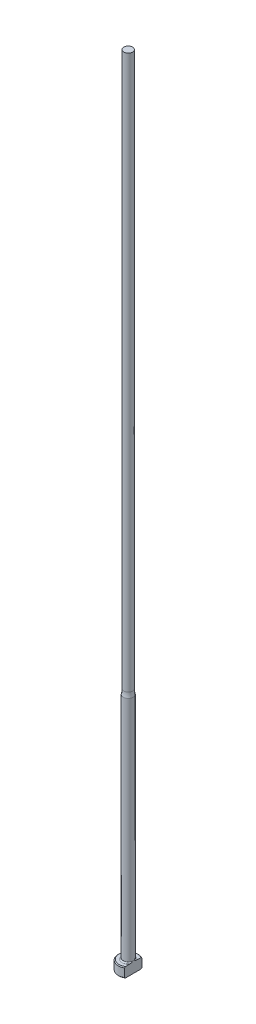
ISO-10303-21;
HEADER;
FILE_DESCRIPTION(('STEP AP214'),'2;1');
FILE_NAME('part.step','',(''),(''),'','','');
FILE_SCHEMA(('AUTOMOTIVE_DESIGN { 1 0 10303 214 1 1 1 1 }'));
ENDSEC;
DATA;
#1=APPLICATION_CONTEXT('core data for automotive mechanical design processes');
#2=APPLICATION_PROTOCOL_DEFINITION('international standard','automotive_design',2000,#1);
#3=PRODUCT_CONTEXT('',#1,'mechanical');
#4=PRODUCT('Part','Part','',(#3));
#5=PRODUCT_RELATED_PRODUCT_CATEGORY('part','',(#4));
#6=PRODUCT_DEFINITION_FORMATION('','',#4);
#7=PRODUCT_DEFINITION_CONTEXT('part definition',#1,'design');
#8=PRODUCT_DEFINITION('design','',#6,#7);
#9=PRODUCT_DEFINITION_SHAPE('','',#8);
#10=(LENGTH_UNIT() NAMED_UNIT(*) SI_UNIT(.MILLI.,.METRE.));
#11=(NAMED_UNIT(*) PLANE_ANGLE_UNIT() SI_UNIT($,.RADIAN.));
#12=(NAMED_UNIT(*) SI_UNIT($,.STERADIAN.) SOLID_ANGLE_UNIT());
#13=UNCERTAINTY_MEASURE_WITH_UNIT(LENGTH_MEASURE(1.E-05),#10,'distance_accuracy_value','');
#14=(GEOMETRIC_REPRESENTATION_CONTEXT(3) GLOBAL_UNCERTAINTY_ASSIGNED_CONTEXT((#13)) GLOBAL_UNIT_ASSIGNED_CONTEXT((#10,
#11,#12)) REPRESENTATION_CONTEXT('',''));
#15=CARTESIAN_POINT('',(0.,0.,0.));
#16=DIRECTION('',(0.,0.,1.));
#17=DIRECTION('',(1.,0.,0.));
#18=AXIS2_PLACEMENT_3D('',#15,#16,#17);
#19=CARTESIAN_POINT('',(-3.17499999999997,3.175,0.));
#20=DIRECTION('',(0.,1.,0.));
#21=DIRECTION('',(0.,0.,1.));
#22=AXIS2_PLACEMENT_3D('',#19,#20,#21);
#23=PLANE('',#22);
#24=CARTESIAN_POINT('',(0.,3.175,0.));
#25=DIRECTION('',(0.,1.,0.));
#26=DIRECTION('',(0.,0.,1.));
#27=AXIS2_PLACEMENT_3D('',#24,#25,#26);
#28=CIRCLE('',#27,2.92099999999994);
#29=CARTESIAN_POINT('',(1.58749999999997,3.175,-2.45195529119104));
#30=VERTEX_POINT('',#29);
#31=CARTESIAN_POINT('',(1.58749999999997,3.175,2.45195529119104));
#32=VERTEX_POINT('',#31);
#33=EDGE_CURVE('E105',#30,#32,#28,.T.);
#34=ORIENTED_EDGE('',*,*,#33,.T.);
#35=DIRECTION('',(0.,0.,1.));
#36=VECTOR('',#35,1.);
#37=CARTESIAN_POINT('',(1.58749999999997,3.17499999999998,2.74963065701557));
#38=LINE('',#37,#36);
#39=CARTESIAN_POINT('',(1.58749999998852,3.175,1.16397422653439));
#40=VERTEX_POINT('',#39);
#41=EDGE_CURVE('E126',#40,#32,#38,.T.);
#42=ORIENTED_EDGE('',*,*,#41,.F.);
#43=CARTESIAN_POINT('',(0.,3.175,0.));
#44=DIRECTION('',(0.,1.,0.));
#45=DIRECTION('',(0.,0.,1.));
#46=AXIS2_PLACEMENT_3D('',#43,#44,#45);
#47=CIRCLE('',#46,1.96849999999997);
#48=CARTESIAN_POINT('',(1.58749999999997,3.175,-1.16397422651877));
#49=VERTEX_POINT('',#48);
#50=EDGE_CURVE('E11',#40,#49,#47,.F.);
#51=ORIENTED_EDGE('',*,*,#50,.T.);
#52=EDGE_CURVE('E52',#30,#49,#38,.T.);
#53=ORIENTED_EDGE('',*,*,#52,.F.);
#54=EDGE_LOOP('',(#34,#42,#51,#53));
#55=FACE_BOUND('',#54,.T.);
#56=ADVANCED_FACE('F32',(#55),#23,.T.);
#57=CARTESIAN_POINT('',(0.,259.958771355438,0.));
#58=DIRECTION('',(0.,1.,0.));
#59=DIRECTION('',(0.,0.,1.));
#60=AXIS2_PLACEMENT_3D('',#57,#58,#59);
#61=CYLINDRICAL_SURFACE('',#60,3.17499999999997);
#62=CARTESIAN_POINT('',(0.,2.92100000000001,0.));
#63=DIRECTION('',(0.,1.,0.));
#64=DIRECTION('',(0.,0.,1.));
#65=AXIS2_PLACEMENT_3D('',#62,#63,#64);
#66=CIRCLE('',#65,3.17499999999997);
#67=CARTESIAN_POINT('',(1.58749999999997,2.92100000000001,2.74963065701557));
#68=VERTEX_POINT('',#67);
#69=CARTESIAN_POINT('',(1.58749999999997,2.92100000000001,-2.74963065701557));
#70=VERTEX_POINT('',#69);
#71=EDGE_CURVE('E98',#68,#70,#66,.F.);
#72=ORIENTED_EDGE('',*,*,#71,.T.);
#73=DIRECTION('',(0.,-1.,0.));
#74=VECTOR('',#73,1.);
#75=CARTESIAN_POINT('',(1.58749999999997,254.001,-2.74963065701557));
#76=LINE('',#75,#74);
#77=CARTESIAN_POINT('',(1.58749999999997,0.253999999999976,-2.74963065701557));
#78=VERTEX_POINT('',#77);
#79=EDGE_CURVE('E141',#70,#78,#76,.T.);
#80=ORIENTED_EDGE('',*,*,#79,.T.);
#81=CARTESIAN_POINT('',(0.,0.253999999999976,0.));
#82=DIRECTION('',(0.,-1.,0.));
#83=DIRECTION('',(0.,0.,-1.));
#84=AXIS2_PLACEMENT_3D('',#81,#82,#83);
#85=CIRCLE('',#84,3.17499999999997);
#86=CARTESIAN_POINT('',(1.58749999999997,0.253999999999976,2.74963065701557));
#87=VERTEX_POINT('',#86);
#88=EDGE_CURVE('E95',#78,#87,#85,.F.);
#89=ORIENTED_EDGE('',*,*,#88,.T.);
#90=DIRECTION('',(0.,-1.,0.));
#91=VECTOR('',#90,1.);
#92=CARTESIAN_POINT('',(1.58749999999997,254.001,2.74963065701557));
#93=LINE('',#92,#91);
#94=EDGE_CURVE('E88',#68,#87,#93,.T.);
#95=ORIENTED_EDGE('',*,*,#94,.F.);
#96=EDGE_LOOP('',(#72,#80,#89,#95));
#97=FACE_BOUND('',#96,.T.);
#98=ADVANCED_FACE('F191',(#97),#61,.T.);
#99=CARTESIAN_POINT('',(0.,0.,0.));
#100=DIRECTION('',(0.,-1.,0.));
#101=DIRECTION('',(0.,0.,-1.));
#102=AXIS2_PLACEMENT_3D('',#99,#100,#101);
#103=PLANE('',#102);
#104=CARTESIAN_POINT('',(0.,0.,0.));
#105=DIRECTION('',(0.,-1.,0.));
#106=DIRECTION('',(0.,0.,-1.));
#107=AXIS2_PLACEMENT_3D('',#104,#105,#106);
#108=CIRCLE('',#107,2.92100000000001);
#109=CARTESIAN_POINT('',(1.58749999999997,0.,2.45195529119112));
#110=VERTEX_POINT('',#109);
#111=CARTESIAN_POINT('',(1.58749999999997,0.,-2.45195529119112));
#112=VERTEX_POINT('',#111);
#113=EDGE_CURVE('E93',#110,#112,#108,.T.);
#114=ORIENTED_EDGE('',*,*,#113,.T.);
#115=DIRECTION('',(0.,0.,1.));
#116=VECTOR('',#115,1.);
#117=CARTESIAN_POINT('',(1.58749999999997,0.,2.74963065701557));
#118=LINE('',#117,#116);
#119=EDGE_CURVE('E78',#112,#110,#118,.T.);
#120=ORIENTED_EDGE('',*,*,#119,.T.);
#121=EDGE_LOOP('',(#114,#120));
#122=FACE_BOUND('',#121,.T.);
#123=ADVANCED_FACE('F97',(#122),#103,.T.);
#124=CARTESIAN_POINT('',(0.,3.17499999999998,0.));
#125=DIRECTION('',(0.,-1.,0.));
#126=DIRECTION('',(0.,0.,-1.));
#127=AXIS2_PLACEMENT_3D('',#124,#125,#126);
#128=CONICAL_SURFACE('',#127,2.92099999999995,0.785398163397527);
#129=ORIENTED_EDGE('',*,*,#71,.F.);
#130=CARTESIAN_POINT('',(1.58749999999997,-0.16162066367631,-6.0529050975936));
#131=CARTESIAN_POINT('',(1.58749999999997,-0.0288893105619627,-5.91567682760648));
#132=CARTESIAN_POINT('',(1.58749999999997,0.103699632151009,-5.7783103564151));
#133=CARTESIAN_POINT('',(1.58749999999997,0.368508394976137,-5.50321874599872));
#134=CARTESIAN_POINT('',(1.58749999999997,0.500728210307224,-5.36549360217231));
#135=CARTESIAN_POINT('',(1.58749999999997,0.764778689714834,-5.08953516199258));
#136=CARTESIAN_POINT('',(1.58749999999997,0.896609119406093,-4.9513016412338));
#137=CARTESIAN_POINT('',(1.58749999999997,1.15968706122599,-4.67428233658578));
#138=CARTESIAN_POINT('',(1.58749999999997,1.29093457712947,-4.53549655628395));
#139=CARTESIAN_POINT('',(1.58749999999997,1.55007705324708,-4.25997724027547));
#140=CARTESIAN_POINT('',(1.58749999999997,1.67798684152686,-4.12325766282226));
#141=CARTESIAN_POINT('',(1.58749999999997,1.9328486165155,-3.84892898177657));
#142=CARTESIAN_POINT('',(1.58749999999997,2.05980060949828,-3.71131988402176));
#143=CARTESIAN_POINT('',(1.58749999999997,2.31237508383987,-3.43493978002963));
#144=CARTESIAN_POINT('',(1.58749999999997,2.43799784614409,-3.29616903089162));
#145=CARTESIAN_POINT('',(1.58749999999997,2.68741369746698,-3.01699558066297));
#146=CARTESIAN_POINT('',(1.58749999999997,2.81120686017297,-2.8765929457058));
#147=CARTESIAN_POINT('',(1.58749999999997,3.00875865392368,-2.64816703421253));
#148=CARTESIAN_POINT('',(1.58749999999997,3.08336151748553,-2.56087478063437));
#149=CARTESIAN_POINT('',(1.58749999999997,3.2312387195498,-2.38515423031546));
#150=CARTESIAN_POINT('',(1.58749999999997,3.30451292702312,-2.29672582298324));
#151=CARTESIAN_POINT('',(1.58749999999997,3.45004422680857,-2.1174740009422));
#152=CARTESIAN_POINT('',(1.58749999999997,3.5222823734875,-2.02663514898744));
#153=CARTESIAN_POINT('',(1.58749999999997,3.66423097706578,-1.8430252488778));
#154=CARTESIAN_POINT('',(1.58749999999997,3.73394203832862,-1.75025467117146));
#155=CARTESIAN_POINT('',(1.58749999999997,3.87080633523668,-1.5606747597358));
#156=CARTESIAN_POINT('',(1.58749999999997,3.93790459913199,-1.46382547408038));
#157=CARTESIAN_POINT('',(1.58749999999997,4.06669147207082,-1.26632594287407));
#158=CARTESIAN_POINT('',(1.58749999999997,4.1283726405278,-1.16567073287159));
#159=CARTESIAN_POINT('',(1.58749999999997,4.21402252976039,-1.01165766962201));
#160=CARTESIAN_POINT('',(1.58749999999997,4.24127929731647,-0.960142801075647));
#161=CARTESIAN_POINT('',(1.58749999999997,4.2930979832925,-0.855780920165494));
#162=CARTESIAN_POINT('',(1.58749999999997,4.31765941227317,-0.802933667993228));
#163=CARTESIAN_POINT('',(1.58749999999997,4.38614656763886,-0.642461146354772));
#164=CARTESIAN_POINT('',(1.58749999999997,4.42510149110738,-0.532518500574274));
#165=CARTESIAN_POINT('',(1.58749999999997,4.46726244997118,-0.367680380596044));
#166=CARTESIAN_POINT('',(1.58749999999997,4.47844427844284,-0.314802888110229));
#167=CARTESIAN_POINT('',(1.58749999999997,4.49576654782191,-0.208209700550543));
#168=CARTESIAN_POINT('',(1.58749999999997,4.50190743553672,-0.154494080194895));
#169=CARTESIAN_POINT('',(1.58749999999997,4.50871296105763,-0.0468792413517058));
#170=CARTESIAN_POINT('',(1.58749999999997,4.5093945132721,0.00701889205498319));
#171=CARTESIAN_POINT('',(1.58749999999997,4.50527679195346,0.114606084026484));
#172=CARTESIAN_POINT('',(1.58749999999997,4.50047706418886,0.168295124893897));
#173=CARTESIAN_POINT('',(1.58749999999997,4.48579689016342,0.27448544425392));
#174=CARTESIAN_POINT('',(1.58749999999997,4.47596081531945,0.32699298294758));
#175=CARTESIAN_POINT('',(1.58749999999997,4.45181809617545,0.430974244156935));
#176=CARTESIAN_POINT('',(1.58749999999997,4.4375096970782,0.482447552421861));
#177=CARTESIAN_POINT('',(1.58749999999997,4.40502489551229,0.584460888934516));
#178=CARTESIAN_POINT('',(1.58749999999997,4.386827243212,0.634994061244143));
#179=CARTESIAN_POINT('',(1.58749999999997,4.34729308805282,0.734789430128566));
#180=CARTESIAN_POINT('',(1.58749999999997,4.3259572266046,0.784051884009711));
#181=CARTESIAN_POINT('',(1.58749999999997,4.25791922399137,0.930549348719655));
#182=CARTESIAN_POINT('',(1.58749999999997,4.20736047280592,1.0259880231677));
#183=CARTESIAN_POINT('',(1.58749999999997,4.0995545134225,1.21304313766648));
#184=CARTESIAN_POINT('',(1.58749999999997,4.04229912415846,1.30465471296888));
#185=CARTESIAN_POINT('',(1.58749999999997,3.92308746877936,1.48526211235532));
#186=CARTESIAN_POINT('',(1.58749999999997,3.86111349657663,1.57424615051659));
#187=CARTESIAN_POINT('',(1.58749999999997,3.73408621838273,1.74990003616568));
#188=CARTESIAN_POINT('',(1.58749999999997,3.66903444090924,1.83657099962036));
#189=CARTESIAN_POINT('',(1.58749999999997,3.53583371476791,2.00931764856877));
#190=CARTESIAN_POINT('',(1.58749999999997,3.46765527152,2.09537048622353));
#191=CARTESIAN_POINT('',(1.58749999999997,3.32960643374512,2.26611736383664));
#192=CARTESIAN_POINT('',(1.58749999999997,3.25973586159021,2.35081125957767));
#193=CARTESIAN_POINT('',(1.58749999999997,3.04858139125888,2.60290121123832));
#194=CARTESIAN_POINT('',(1.58749999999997,2.90542388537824,2.76872537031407));
#195=CARTESIAN_POINT('',(1.58749999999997,2.64069522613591,3.06970913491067));
#196=CARTESIAN_POINT('',(1.58749999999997,2.51959458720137,3.20528660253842));
#197=CARTESIAN_POINT('',(1.58749999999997,2.27590400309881,3.47510321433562));
#198=CARTESIAN_POINT('',(1.58749999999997,2.15331401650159,3.60934232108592));
#199=CARTESIAN_POINT('',(1.58749999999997,1.90694239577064,3.87695374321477));
#200=CARTESIAN_POINT('',(1.58749999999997,1.78315974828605,4.0103251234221));
#201=CARTESIAN_POINT('',(1.58749999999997,1.53478104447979,4.27630880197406));
#202=CARTESIAN_POINT('',(1.58749999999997,1.41018498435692,4.40892109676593));
#203=CARTESIAN_POINT('',(1.58749999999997,1.0457468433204,4.79499418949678));
#204=CARTESIAN_POINT('',(1.58749999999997,0.80507680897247,5.04767313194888));
#205=CARTESIAN_POINT('',(1.58749999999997,0.443121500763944,5.42550911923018));
#206=CARTESIAN_POINT('',(1.58749999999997,0.322378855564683,5.55118772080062));
#207=CARTESIAN_POINT('',(1.58749999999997,0.0805914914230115,5.80225207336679));
#208=CARTESIAN_POINT('',(1.58749999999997,-0.040453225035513,5.92763782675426));
#209=CARTESIAN_POINT('',(1.58749999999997,-0.161620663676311,6.0529050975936));
#210=B_SPLINE_CURVE_WITH_KNOTS('',3,(#130,#131,#132,#133,#134,#135,#136,#137,#138,#139,#140,
#141,#142,#143,#144,#145,#146,#147,#148,#149,#150,#151,#152,#153,#154,#155,#156,#157,#158,#159,
#160,#161,#162,#163,#164,#165,#166,#167,#168,#169,#170,#171,#172,#173,#174,#175,#176,#177,#178,
#179,#180,#181,#182,#183,#184,#185,#186,#187,#188,#189,#190,#191,#192,#193,#194,#195,#196,#197,
#198,#199,#200,#201,#202,#203,#204,#205,#206,#207,#208,#209),.UNSPECIFIED.,.F.,.F.,(4,2,2,2,2,2,
2,2,2,2,2,2,2,2,2,2,2,2,2,2,2,2,2,2,2,2,2,2,2,2,2,2,2,2,2,2,2,2,2,4),(0.,0.572750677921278,
1.14550874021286,1.71856057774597,2.29160869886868,2.85328006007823,3.4149477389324,
3.97649423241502,4.53801804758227,4.88249307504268,5.22700189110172,5.5751532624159,
5.92322081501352,6.27657800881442,6.63041319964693,6.80518126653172,6.9799810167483,
7.3282426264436,7.49018491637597,7.65211285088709,7.81353889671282,7.97497832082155,
8.13501929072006,8.29512313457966,8.45612518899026,8.61709438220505,8.94062993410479,
9.2645649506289,9.58978187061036,9.91483894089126,10.2441741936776,10.5735441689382,
11.2306812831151,11.7760337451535,12.3214014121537,12.8672825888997,13.4131663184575,
14.4600164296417,14.9828595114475,15.5056983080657),.UNSPECIFIED.);
#211=EDGE_CURVE('E118',#32,#68,#210,.T.);
#212=ORIENTED_EDGE('',*,*,#211,.F.);
#213=ORIENTED_EDGE('',*,*,#33,.F.);
#214=EDGE_CURVE('E117',#70,#30,#210,.T.);
#215=ORIENTED_EDGE('',*,*,#214,.F.);
#216=EDGE_LOOP('',(#129,#212,#213,#215));
#217=FACE_BOUND('',#216,.T.);
#218=ADVANCED_FACE('F162',(#217),#128,.T.);
#219=CARTESIAN_POINT('',(0.,0.253999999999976,0.));
#220=DIRECTION('',(0.,1.,0.));
#221=DIRECTION('',(0.,0.,1.));
#222=AXIS2_PLACEMENT_3D('',#219,#220,#221);
#223=CONICAL_SURFACE('',#222,3.17499999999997,0.785398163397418);
#224=ORIENTED_EDGE('',*,*,#88,.F.);
#225=CARTESIAN_POINT('',(1.58749999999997,3.33662066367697,6.0529050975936));
#226=CARTESIAN_POINT('',(1.58749999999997,3.20388931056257,5.91567682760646));
#227=CARTESIAN_POINT('',(1.58749999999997,3.07130036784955,5.77831035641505));
#228=CARTESIAN_POINT('',(1.58749999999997,2.80649160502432,5.50321874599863));
#229=CARTESIAN_POINT('',(1.58749999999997,2.67427178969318,5.3654936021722));
#230=CARTESIAN_POINT('',(1.58749999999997,2.41022131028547,5.08953516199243));
#231=CARTESIAN_POINT('',(1.58749999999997,2.27839088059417,4.95130164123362));
#232=CARTESIAN_POINT('',(1.58749999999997,2.01531293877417,4.67428233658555));
#233=CARTESIAN_POINT('',(1.58749999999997,1.88406542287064,4.5354965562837));
#234=CARTESIAN_POINT('',(1.58749999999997,1.62492294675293,4.25997724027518));
#235=CARTESIAN_POINT('',(1.58749999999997,1.49701315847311,4.12325766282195));
#236=CARTESIAN_POINT('',(1.58749999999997,1.24215138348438,3.84892898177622));
#237=CARTESIAN_POINT('',(1.58749999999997,1.11519939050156,3.71131988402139));
#238=CARTESIAN_POINT('',(1.58749999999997,0.862624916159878,3.43493978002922));
#239=CARTESIAN_POINT('',(1.58749999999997,0.737002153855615,3.29616903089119));
#240=CARTESIAN_POINT('',(1.58749999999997,0.487586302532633,3.01699558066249));
#241=CARTESIAN_POINT('',(1.58749999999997,0.363793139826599,2.8765929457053));
#242=CARTESIAN_POINT('',(1.58749999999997,0.166241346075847,2.64816703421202));
#243=CARTESIAN_POINT('',(1.58749999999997,0.0916384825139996,2.56087478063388));
#244=CARTESIAN_POINT('',(1.58749999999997,-0.0562387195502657,2.385154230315));
#245=CARTESIAN_POINT('',(1.58749999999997,-0.129512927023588,2.29672582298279));
#246=CARTESIAN_POINT('',(1.58749999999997,-0.27504422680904,2.11747400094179));
#247=CARTESIAN_POINT('',(1.58749999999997,-0.347282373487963,2.02663514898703));
#248=CARTESIAN_POINT('',(1.58749999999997,-0.489230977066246,1.84302524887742));
#249=CARTESIAN_POINT('',(1.58749999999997,-0.558942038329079,1.7502546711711));
#250=CARTESIAN_POINT('',(1.58749999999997,-0.695806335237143,1.56067475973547));
#251=CARTESIAN_POINT('',(1.58749999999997,-0.762904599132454,1.46382547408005));
#252=CARTESIAN_POINT('',(1.58749999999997,-0.891691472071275,1.26632594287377));
#253=CARTESIAN_POINT('',(1.58749999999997,-0.953372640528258,1.16567073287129));
#254=CARTESIAN_POINT('',(1.58749999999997,-1.03902252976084,1.01165766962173));
#255=CARTESIAN_POINT('',(1.58749999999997,-1.06627929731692,0.960142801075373));
#256=CARTESIAN_POINT('',(1.58749999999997,-1.11809798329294,0.85578092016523));
#257=CARTESIAN_POINT('',(1.58749999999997,-1.14265941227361,0.802933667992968));
#258=CARTESIAN_POINT('',(1.58749999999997,-1.21114656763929,0.642461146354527));
#259=CARTESIAN_POINT('',(1.58749999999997,-1.2501014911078,0.532518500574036));
#260=CARTESIAN_POINT('',(1.58749999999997,-1.29226244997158,0.367680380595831));
#261=CARTESIAN_POINT('',(1.58749999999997,-1.30344427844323,0.314802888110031));
#262=CARTESIAN_POINT('',(1.58749999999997,-1.32076654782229,0.208209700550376));
#263=CARTESIAN_POINT('',(1.58749999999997,-1.3269074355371,0.154494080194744));
#264=CARTESIAN_POINT('',(1.58749999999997,-1.333712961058,0.0468792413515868));
#265=CARTESIAN_POINT('',(1.58749999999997,-1.33439451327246,-0.00701889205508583));
#266=CARTESIAN_POINT('',(1.58749999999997,-1.33027679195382,-0.114606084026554));
#267=CARTESIAN_POINT('',(1.58749999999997,-1.32547706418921,-0.168295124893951));
#268=CARTESIAN_POINT('',(1.58749999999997,-1.31079689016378,-0.274485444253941));
#269=CARTESIAN_POINT('',(1.58749999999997,-1.3009608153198,-0.326992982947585));
#270=CARTESIAN_POINT('',(1.58749999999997,-1.27681809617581,-0.430974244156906));
#271=CARTESIAN_POINT('',(1.58749999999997,-1.26250969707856,-0.482447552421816));
#272=CARTESIAN_POINT('',(1.58749999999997,-1.23002489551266,-0.584460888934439));
#273=CARTESIAN_POINT('',(1.58749999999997,-1.21182724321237,-0.634994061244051));
#274=CARTESIAN_POINT('',(1.58749999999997,-1.1722930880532,-0.734789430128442));
#275=CARTESIAN_POINT('',(1.58749999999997,-1.15095722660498,-0.784051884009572));
#276=CARTESIAN_POINT('',(1.58749999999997,-1.08291922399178,-0.93054934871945));
#277=CARTESIAN_POINT('',(1.58749999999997,-1.03236047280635,-1.02598802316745));
#278=CARTESIAN_POINT('',(1.58749999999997,-0.924554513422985,-1.21304313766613));
#279=CARTESIAN_POINT('',(1.58749999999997,-0.86729912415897,-1.30465471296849));
#280=CARTESIAN_POINT('',(1.58749999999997,-0.748087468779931,-1.48526211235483));
#281=CARTESIAN_POINT('',(1.58749999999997,-0.686113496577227,-1.57424615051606));
#282=CARTESIAN_POINT('',(1.58749999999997,-0.55908621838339,-1.74990003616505));
#283=CARTESIAN_POINT('',(1.58749999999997,-0.494034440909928,-1.83657099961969));
#284=CARTESIAN_POINT('',(1.58749999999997,-0.360833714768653,-2.00931764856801));
#285=CARTESIAN_POINT('',(1.58749999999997,-0.292655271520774,-2.09537048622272));
#286=CARTESIAN_POINT('',(1.58749999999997,-0.154606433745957,-2.26611736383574));
#287=CARTESIAN_POINT('',(1.58749999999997,-0.0847358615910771,-2.35081125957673));
#288=CARTESIAN_POINT('',(1.58749999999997,0.126418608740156,-2.60290121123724));
#289=CARTESIAN_POINT('',(1.58749999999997,0.269576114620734,-2.76872537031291));
#290=CARTESIAN_POINT('',(1.58749999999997,0.534304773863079,-3.06970913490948));
#291=CARTESIAN_POINT('',(1.58749999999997,0.655405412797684,-3.20528660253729));
#292=CARTESIAN_POINT('',(1.58749999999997,0.899095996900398,-3.47510321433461));
#293=CARTESIAN_POINT('',(1.58749999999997,1.02168598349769,-3.60934232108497));
#294=CARTESIAN_POINT('',(1.58749999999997,1.26805760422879,-3.87695374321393));
#295=CARTESIAN_POINT('',(1.58749999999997,1.39184025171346,-4.01032512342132));
#296=CARTESIAN_POINT('',(1.58749999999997,1.64021895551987,-4.2763088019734));
#297=CARTESIAN_POINT('',(1.58749999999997,1.76481501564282,-4.40892109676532));
#298=CARTESIAN_POINT('',(1.58749999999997,2.12925315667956,-4.79499418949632));
#299=CARTESIAN_POINT('',(1.58749999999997,2.36992319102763,-5.04767313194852));
#300=CARTESIAN_POINT('',(1.58749999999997,2.73187849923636,-5.42550911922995));
#301=CARTESIAN_POINT('',(1.58749999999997,2.85262114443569,-5.55118772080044));
#302=CARTESIAN_POINT('',(1.58749999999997,3.09440850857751,-5.8022520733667));
#303=CARTESIAN_POINT('',(1.58749999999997,3.2154532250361,-5.92763782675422));
#304=CARTESIAN_POINT('',(1.58749999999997,3.33662066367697,-6.0529050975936));
#305=B_SPLINE_CURVE_WITH_KNOTS('',3,(#225,#226,#227,#228,#229,#230,#231,#232,#233,#234,#235,
#236,#237,#238,#239,#240,#241,#242,#243,#244,#245,#246,#247,#248,#249,#250,#251,#252,#253,#254,
#255,#256,#257,#258,#259,#260,#261,#262,#263,#264,#265,#266,#267,#268,#269,#270,#271,#272,#273,
#274,#275,#276,#277,#278,#279,#280,#281,#282,#283,#284,#285,#286,#287,#288,#289,#290,#291,#292,
#293,#294,#295,#296,#297,#298,#299,#300,#301,#302,#303,#304),.UNSPECIFIED.,.F.,.F.,(4,2,2,2,2,2,
2,2,2,2,2,2,2,2,2,2,2,2,2,2,2,2,2,2,2,2,2,2,2,2,2,2,2,2,2,2,2,2,2,4),(0.,0.57275067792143,
1.14550874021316,1.71856057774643,2.29160869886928,2.85328006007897,3.41494773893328,
3.97649423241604,4.53801804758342,4.88249307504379,5.2270018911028,5.57515326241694,
5.92322081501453,6.27657800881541,6.63041319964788,6.80518126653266,6.97998101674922,
7.32824262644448,7.49018491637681,7.65211285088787,7.81353889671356,7.97497832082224,
8.1350192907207,8.29512313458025,8.45612518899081,8.61709438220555,8.94062993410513,
9.26456495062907,9.58978187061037,9.91483894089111,10.2441741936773,10.5735441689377,
11.2306812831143,11.776033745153,12.3214014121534,12.8672825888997,13.4131663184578,
14.4600164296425,14.9828595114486,15.505698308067),.UNSPECIFIED.);
#306=EDGE_CURVE('E81',#112,#78,#305,.T.);
#307=ORIENTED_EDGE('',*,*,#306,.F.);
#308=ORIENTED_EDGE('',*,*,#113,.F.);
#309=EDGE_CURVE('E84',#87,#110,#305,.T.);
#310=ORIENTED_EDGE('',*,*,#309,.F.);
#311=EDGE_LOOP('',(#224,#307,#308,#310));
#312=FACE_BOUND('',#311,.T.);
#313=ADVANCED_FACE('F92',(#312),#223,.T.);
#314=CARTESIAN_POINT('',(0.,3.556,0.));
#315=DIRECTION('',(0.,1.,0.));
#316=DIRECTION('',(0.,0.,1.));
#317=AXIS2_PLACEMENT_3D('',#314,#315,#316);
#318=TOROIDAL_SURFACE('',#317,1.96849999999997,0.381);
#319=CARTESIAN_POINT('',(1.58749999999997,3.556,0.));
#320=CARTESIAN_POINT('',(1.58749999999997,3.55599928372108,-9.72839998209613E-12));
#321=CARTESIAN_POINT('',(1.58749999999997,3.55599856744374,-1.16390048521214E-07));
#322=CARTESIAN_POINT('',(1.58749999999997,3.55599717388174,-5.02802253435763E-07));
#323=CARTESIAN_POINT('',(1.58749999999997,3.55599649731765,-7.75049116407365E-07));
#324=CARTESIAN_POINT('',(1.58749999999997,3.55599515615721,-1.43578185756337E-06));
#325=CARTESIAN_POINT('',(1.58749999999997,3.55599449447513,-1.83004116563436E-06));
#326=CARTESIAN_POINT('',(1.58749999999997,3.55599322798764,-2.69326525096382E-06));
#327=CARTESIAN_POINT('',(1.58749999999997,3.55599262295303,-3.16190628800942E-06));
#328=CARTESIAN_POINT('',(1.58749999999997,3.55599066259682,-4.80183833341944E-06));
#329=CARTESIAN_POINT('',(1.58749999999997,3.55598938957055,-6.07237548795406E-06));
#330=CARTESIAN_POINT('',(1.58749999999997,3.55598706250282,-8.74131694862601E-06));
#331=CARTESIAN_POINT('',(1.58749999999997,3.55598600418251,-1.01362054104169E-05));
#332=CARTESIAN_POINT('',(1.58749999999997,3.55598220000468,-1.54025644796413E-05));
#333=CARTESIAN_POINT('',(1.58749999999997,3.55597966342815,-1.94297992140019E-05));
#334=CARTESIAN_POINT('',(1.58749999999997,3.55597535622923,-2.75116574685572E-05));
#335=CARTESIAN_POINT('',(1.58749999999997,3.55597354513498,-3.15456374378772E-05));
#336=CARTESIAN_POINT('',(1.58749999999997,3.55596616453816,-4.82039076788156E-05));
#337=CARTESIAN_POINT('',(1.58749999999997,3.55596077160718,-6.08993138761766E-05));
#338=CARTESIAN_POINT('',(1.58749999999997,3.55595181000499,-8.49758225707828E-05));
#339=CARTESIAN_POINT('',(1.58749999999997,3.55594809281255,-9.6299831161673E-05));
#340=CARTESIAN_POINT('',(1.58749999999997,3.55591954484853,-0.000176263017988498));
#341=CARTESIAN_POINT('',(1.58749999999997,3.55588430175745,-0.000240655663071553));
#342=CARTESIAN_POINT('',(1.58749999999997,3.55575419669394,-0.000487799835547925));
#343=CARTESIAN_POINT('',(1.58749999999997,3.55566706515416,-0.000673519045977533));
#344=CARTESIAN_POINT('',(1.58749999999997,3.55532896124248,-0.00138308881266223));
#345=CARTESIAN_POINT('',(1.58749999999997,3.55506990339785,-0.0019038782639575));
#346=CARTESIAN_POINT('',(1.58749999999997,3.55403272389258,-0.00399959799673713));
#347=CARTESIAN_POINT('',(1.58749999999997,3.55326363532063,-0.0055779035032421));
#348=CARTESIAN_POINT('',(1.58749999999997,3.53734419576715,-0.0382341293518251));
#349=CARTESIAN_POINT('',(1.58749999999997,3.52209124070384,-0.0692744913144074));
#350=CARTESIAN_POINT('',(1.58749999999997,3.49234031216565,-0.130397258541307));
#351=CARTESIAN_POINT('',(1.58749999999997,3.4778343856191,-0.160476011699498));
#352=CARTESIAN_POINT('',(1.58749999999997,3.44756579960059,-0.22405302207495));
#353=CARTESIAN_POINT('',(1.58749999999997,3.43183768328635,-0.257567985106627));
#354=CARTESIAN_POINT('',(1.58749999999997,3.40084315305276,-0.325196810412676));
#355=CARTESIAN_POINT('',(1.58749999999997,3.38558252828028,-0.359313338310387));
#356=CARTESIAN_POINT('',(1.58749999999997,3.35947844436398,-0.419670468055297));
#357=CARTESIAN_POINT('',(1.58749999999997,3.34845502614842,-0.445832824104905));
#358=CARTESIAN_POINT('',(1.58749999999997,3.32703860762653,-0.498343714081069));
#359=CARTESIAN_POINT('',(1.58749999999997,3.31664422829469,-0.52469168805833));
#360=CARTESIAN_POINT('',(1.58749999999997,3.2869407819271,-0.603098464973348));
#361=CARTESIAN_POINT('',(1.58749999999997,3.26865317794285,-0.655557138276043));
#362=CARTESIAN_POINT('',(1.58749999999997,3.24332469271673,-0.737608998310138));
#363=CARTESIAN_POINT('',(1.58749999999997,3.23494346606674,-0.766787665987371));
#364=CARTESIAN_POINT('',(1.58749999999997,3.21949479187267,-0.825628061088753));
#365=CARTESIAN_POINT('',(1.58749999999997,3.21243348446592,-0.855291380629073));
#366=CARTESIAN_POINT('',(1.58749999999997,3.19303275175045,-0.947623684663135));
#367=CARTESIAN_POINT('',(1.58749999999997,3.18336484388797,-1.01091582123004));
#368=CARTESIAN_POINT('',(1.58749999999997,3.17464826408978,-1.12491727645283));
#369=CARTESIAN_POINT('',(1.58749999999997,3.17379742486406,-1.17548103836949));
#370=CARTESIAN_POINT('',(1.58749999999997,3.17980825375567,-1.2756075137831));
#371=CARTESIAN_POINT('',(1.58749999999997,3.18656467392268,-1.32517446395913));
#372=CARTESIAN_POINT('',(1.58749999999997,3.20510062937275,-1.40268723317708));
#373=CARTESIAN_POINT('',(1.58749999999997,3.21379930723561,-1.43136704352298));
#374=CARTESIAN_POINT('',(1.58749999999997,3.23523847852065,-1.48727388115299));
#375=CARTESIAN_POINT('',(1.58749999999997,3.24798385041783,-1.51449910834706));
#376=CARTESIAN_POINT('',(1.58749999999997,3.27479889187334,-1.56082978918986));
#377=CARTESIAN_POINT('',(1.58749999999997,3.2880084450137,-1.5804296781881));
#378=CARTESIAN_POINT('',(1.58749999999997,3.31738741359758,-1.61726850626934));
#379=CARTESIAN_POINT('',(1.58749999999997,3.33355126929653,-1.63451177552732));
#380=CARTESIAN_POINT('',(1.58749999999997,3.3650209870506,-1.66235366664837));
#381=CARTESIAN_POINT('',(1.58749999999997,3.37976591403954,-1.67358404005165));
#382=CARTESIAN_POINT('',(1.58749999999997,3.41090649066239,-1.69348690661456));
#383=CARTESIAN_POINT('',(1.58749999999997,3.42730148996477,-1.70216040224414));
#384=CARTESIAN_POINT('',(1.58749999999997,3.46152587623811,-1.71647536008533));
#385=CARTESIAN_POINT('',(1.58749999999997,3.47936500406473,-1.72209384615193));
#386=CARTESIAN_POINT('',(1.58749999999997,3.51579449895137,-1.72977101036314));
#387=CARTESIAN_POINT('',(1.58749999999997,3.53438431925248,-1.73183223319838));
#388=CARTESIAN_POINT('',(1.58749999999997,3.5693049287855,-1.73220894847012));
#389=CARTESIAN_POINT('',(1.58749999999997,3.58563247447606,-1.73095378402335));
#390=CARTESIAN_POINT('',(1.58749999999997,3.61782719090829,-1.72566824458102));
#391=CARTESIAN_POINT('',(1.58749999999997,3.6336944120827,-1.72163817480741));
#392=CARTESIAN_POINT('',(1.58749999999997,3.66430913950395,-1.71112762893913));
#393=CARTESIAN_POINT('',(1.58749999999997,3.67907021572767,-1.70468621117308));
#394=CARTESIAN_POINT('',(1.58749999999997,3.7074589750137,-1.68967506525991));
#395=CARTESIAN_POINT('',(1.58749999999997,3.72108625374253,-1.68110458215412));
#396=CARTESIAN_POINT('',(1.58749999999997,3.75190835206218,-1.6586320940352));
#397=CARTESIAN_POINT('',(1.58749999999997,3.76852524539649,-1.64393589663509));
#398=CARTESIAN_POINT('',(1.58749999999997,3.79915076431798,-1.61203006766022));
#399=CARTESIAN_POINT('',(1.58749999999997,3.81315342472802,-1.59481484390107));
#400=CARTESIAN_POINT('',(1.58749999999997,3.84335302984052,-1.55180967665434));
#401=CARTESIAN_POINT('',(1.58749999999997,3.85840997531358,-1.52522183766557));
#402=CARTESIAN_POINT('',(1.58749999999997,3.8840928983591,-1.47008223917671));
#403=CARTESIAN_POINT('',(1.58749999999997,3.89472145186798,-1.44153163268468));
#404=CARTESIAN_POINT('',(1.58749999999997,3.91656912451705,-1.36850699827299));
#405=CARTESIAN_POINT('',(1.58749999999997,3.92534811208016,-1.32330828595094));
#406=CARTESIAN_POINT('',(1.58749999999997,3.93598980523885,-1.23163561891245));
#407=CARTESIAN_POINT('',(1.58749999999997,3.93776012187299,-1.18515271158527));
#408=CARTESIAN_POINT('',(1.58749999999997,3.93485724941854,-1.056626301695));
#409=CARTESIAN_POINT('',(1.58749999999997,3.9241811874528,-0.974728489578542));
#410=CARTESIAN_POINT('',(1.58749999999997,3.899893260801,-0.855941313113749));
#411=CARTESIAN_POINT('',(1.58749999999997,3.89075037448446,-0.817952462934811));
#412=CARTESIAN_POINT('',(1.58749999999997,3.87034922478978,-0.742758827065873));
#413=CARTESIAN_POINT('',(1.58749999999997,3.85910312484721,-0.705550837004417));
#414=CARTESIAN_POINT('',(1.58749999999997,3.83067738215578,-0.618900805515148));
#415=CARTESIAN_POINT('',(1.58749999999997,3.81279292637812,-0.56969368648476));
#416=CARTESIAN_POINT('',(1.58749999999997,3.78404415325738,-0.496059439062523));
#417=CARTESIAN_POINT('',(1.58749999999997,3.77402894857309,-0.471293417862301));
#418=CARTESIAN_POINT('',(1.58749999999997,3.75347166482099,-0.421913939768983));
#419=CARTESIAN_POINT('',(1.58749999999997,3.74292842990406,-0.39730096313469));
#420=CARTESIAN_POINT('',(1.58749999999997,3.71797467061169,-0.340371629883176));
#421=CARTESIAN_POINT('',(1.58749999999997,3.7034106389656,-0.308122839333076));
#422=CARTESIAN_POINT('',(1.58749999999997,3.67389634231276,-0.244169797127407));
#423=CARTESIAN_POINT('',(1.58749999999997,3.65895097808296,-0.212463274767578));
#424=CARTESIAN_POINT('',(1.58749999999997,3.63022587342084,-0.152300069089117));
#425=CARTESIAN_POINT('',(1.58749999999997,3.61647532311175,-0.123829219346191));
#426=CARTESIAN_POINT('',(1.58749999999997,3.58829058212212,-0.065967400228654));
#427=CARTESIAN_POINT('',(1.58749999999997,3.57384944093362,-0.036579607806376));
#428=CARTESIAN_POINT('',(1.58749999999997,3.55873641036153,-0.00557801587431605));
#429=CARTESIAN_POINT('',(1.58749999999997,3.557967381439,-0.00399981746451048));
#430=CARTESIAN_POINT('',(1.58749999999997,3.55693021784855,-0.00190412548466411));
#431=CARTESIAN_POINT('',(1.58749999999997,3.55667111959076,-0.00138325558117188));
#432=CARTESIAN_POINT('',(1.58749999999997,3.55633296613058,-0.00067358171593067));
#433=CARTESIAN_POINT('',(1.58749999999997,3.55624582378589,-0.000487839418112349));
#434=CARTESIAN_POINT('',(1.58749999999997,3.55611570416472,-0.000240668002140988));
#435=CARTESIAN_POINT('',(1.58749999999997,3.55608045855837,-0.000176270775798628));
#436=CARTESIAN_POINT('',(1.58749999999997,3.55605190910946,-9.63021903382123E-05));
#437=CARTESIAN_POINT('',(1.58749999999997,3.55604819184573,-8.49777827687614E-05));
#438=CARTESIAN_POINT('',(1.58749999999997,3.55603922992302,-6.09004217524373E-05));
#439=CARTESIAN_POINT('',(1.58749999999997,3.55603383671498,-4.82045726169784E-05));
#440=CARTESIAN_POINT('',(1.58749999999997,3.55602645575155,-3.15458034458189E-05));
#441=CARTESIAN_POINT('',(1.58749999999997,3.55602464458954,-2.75117552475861E-05));
#442=CARTESIAN_POINT('',(1.58749999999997,3.55602033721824,-1.94297725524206E-05));
#443=CARTESIAN_POINT('',(1.58749999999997,3.55601780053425,-1.54024835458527E-05));
#444=CARTESIAN_POINT('',(1.58749999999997,3.55601399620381,-1.01360754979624E-05));
#445=CARTESIAN_POINT('',(1.58749999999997,3.55601293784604,-8.7411813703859E-06));
#446=CARTESIAN_POINT('',(1.58749999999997,3.55601061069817,-6.07223627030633E-06));
#447=CARTESIAN_POINT('',(1.58749999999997,3.55600933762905,-4.80170138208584E-06));
#448=CARTESIAN_POINT('',(1.58749999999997,3.55600737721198,-3.16178168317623E-06));
#449=CARTESIAN_POINT('',(1.58749999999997,3.55600677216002,-2.69314602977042E-06));
#450=CARTESIAN_POINT('',(1.58749999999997,3.55600550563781,-1.82993577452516E-06));
#451=CARTESIAN_POINT('',(1.58749999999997,3.55600484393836,-1.43568493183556E-06));
#452=CARTESIAN_POINT('',(1.58749999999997,3.55600350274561,-7.74972790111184E-07));
#453=CARTESIAN_POINT('',(1.58749999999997,3.55600282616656,-5.02737772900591E-07));
#454=CARTESIAN_POINT('',(1.58749999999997,3.55600143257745,-1.16354060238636E-07));
#455=CARTESIAN_POINT('',(1.58749999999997,3.55600071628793,9.72852226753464E-12));
#456=CARTESIAN_POINT('',(1.58749999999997,3.556,0.));
#457=B_SPLINE_CURVE_WITH_KNOTS('',3,(#319,#320,#321,#322,#323,#324,#325,#326,#327,#328,#329,
#330,#331,#332,#333,#334,#335,#336,#337,#338,#339,#340,#341,#342,#343,#344,#345,#346,#347,#348,
#349,#350,#351,#352,#353,#354,#355,#356,#357,#358,#359,#360,#361,#362,#363,#364,#365,#366,#367,
#368,#369,#370,#371,#372,#373,#374,#375,#376,#377,#378,#379,#380,#381,#382,#383,#384,#385,#386,
#387,#388,#389,#390,#391,#392,#393,#394,#395,#396,#397,#398,#399,#400,#401,#402,#403,#404,#405,
#406,#407,#408,#409,#410,#411,#412,#413,#414,#415,#416,#417,#418,#419,#420,#421,#422,#423,#424,
#425,#426,#427,#428,#429,#430,#431,#432,#433,#434,#435,#436,#437,#438,#439,#440,#441,#442,#443,
#444,#445,#446,#447,#448,#449,#450,#451,#452,#453,#454,#455,#456),.UNSPECIFIED.,.T.,.F.,(4,2,2,
2,2,2,2,2,2,2,2,2,2,2,2,2,2,2,2,2,2,2,2,2,2,2,2,2,2,2,2,2,2,2,2,2,2,2,2,2,2,2,2,2,2,2,2,2,2,2,2,
2,2,2,2,2,2,2,2,2,2,2,2,2,2,2,2,2,4),(0.,2.14653634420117E-06,4.3243617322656E-06,
6.62715069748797E-06,8.92017875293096E-06,1.42892293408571E-05,1.95376032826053E-05,
3.37616071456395E-05,4.70144492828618E-05,8.83789092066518E-05,0.000124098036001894,
0.000343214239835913,0.000959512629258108,0.00270343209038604,0.00797166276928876,
0.11171345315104,0.21189766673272,0.322958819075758,0.435072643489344,0.520234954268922,
0.605203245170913,0.771741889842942,0.862787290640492,0.954246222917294,1.14571222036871,
1.29701464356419,1.44624921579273,1.53592478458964,1.62570887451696,1.69637166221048,
1.76690281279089,1.82229027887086,1.87765600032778,1.93343255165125,1.98916918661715,
2.03805361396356,2.08693266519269,2.13505202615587,2.18318847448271,2.24937187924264,
2.31570450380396,2.4068617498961,2.49796589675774,2.63532677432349,2.77449244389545,
3.02069049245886,3.13789423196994,3.25444001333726,3.41142684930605,3.491566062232,
3.57188909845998,3.67803747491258,3.78319074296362,3.87804579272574,3.97626481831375,
3.98153268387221,3.98327687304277,3.98389324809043,3.98411237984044,3.98414810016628,
3.98418946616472,3.98420271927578,3.98421694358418,3.98422219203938,3.9842275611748,
3.98422985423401,3.98423215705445,3.98423433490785,3.98423648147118),.UNSPECIFIED.);
#458=CARTESIAN_POINT('',(1.58749999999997,3.556,0.));
#459=VERTEX_POINT('',#458);
#460=EDGE_CURVE('E47',#459,#49,#457,.T.);
#461=ORIENTED_EDGE('',*,*,#460,.T.);
#462=ORIENTED_EDGE('',*,*,#50,.F.);
#463=CARTESIAN_POINT('',(1.58749999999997,3.556,0.));
#464=CARTESIAN_POINT('',(1.58749999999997,3.55600071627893,9.72842792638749E-12));
#465=CARTESIAN_POINT('',(1.58749999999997,3.55600143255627,1.16390048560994E-07));
#466=CARTESIAN_POINT('',(1.58749999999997,3.55600282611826,5.02802253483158E-07));
#467=CARTESIAN_POINT('',(1.58749999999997,3.55600350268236,7.7504911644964E-07));
#468=CARTESIAN_POINT('',(1.58749999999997,3.5560048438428,1.43578185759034E-06));
#469=CARTESIAN_POINT('',(1.58749999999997,3.55600550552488,1.83004116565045E-06));
#470=CARTESIAN_POINT('',(1.58749999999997,3.55600677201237,2.69326525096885E-06));
#471=CARTESIAN_POINT('',(1.58749999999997,3.55600737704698,3.16190628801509E-06));
#472=CARTESIAN_POINT('',(1.58749999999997,3.55600933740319,4.80183833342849E-06));
#473=CARTESIAN_POINT('',(1.58749999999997,3.55601061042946,6.07237548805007E-06));
#474=CARTESIAN_POINT('',(1.58749999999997,3.55601293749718,8.74131694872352E-06));
#475=CARTESIAN_POINT('',(1.58749999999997,3.55601399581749,1.01362054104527E-05));
#476=CARTESIAN_POINT('',(1.58749999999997,3.55601779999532,1.54025644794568E-05));
#477=CARTESIAN_POINT('',(1.58749999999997,3.55602033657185,1.94297992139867E-05));
#478=CARTESIAN_POINT('',(1.58749999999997,3.55602464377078,2.75116574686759E-05));
#479=CARTESIAN_POINT('',(1.58749999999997,3.55602645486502,3.15456374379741E-05));
#480=CARTESIAN_POINT('',(1.58749999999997,3.55603383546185,4.8203907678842E-05));
#481=CARTESIAN_POINT('',(1.58749999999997,3.55603922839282,6.0899313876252E-05));
#482=CARTESIAN_POINT('',(1.58749999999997,3.55604818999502,8.49758225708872E-05));
#483=CARTESIAN_POINT('',(1.58749999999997,3.55605190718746,9.62998311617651E-05));
#484=CARTESIAN_POINT('',(1.58749999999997,3.55608045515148,0.000176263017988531));
#485=CARTESIAN_POINT('',(1.58749999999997,3.55611569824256,0.000240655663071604));
#486=CARTESIAN_POINT('',(1.58749999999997,3.55624580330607,0.000487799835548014));
#487=CARTESIAN_POINT('',(1.58749999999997,3.55633293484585,0.000673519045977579));
#488=CARTESIAN_POINT('',(1.58749999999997,3.55667103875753,0.00138308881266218));
#489=CARTESIAN_POINT('',(1.58749999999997,3.55693009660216,0.00190387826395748));
#490=CARTESIAN_POINT('',(1.58749999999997,3.55796727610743,0.00399959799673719));
#491=CARTESIAN_POINT('',(1.58749999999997,3.55873636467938,0.00557790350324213));
#492=CARTESIAN_POINT('',(1.58749999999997,3.57465580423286,0.038234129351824));
#493=CARTESIAN_POINT('',(1.58749999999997,3.58990875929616,0.0692744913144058));
#494=CARTESIAN_POINT('',(1.58749999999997,3.61965968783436,0.130397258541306));
#495=CARTESIAN_POINT('',(1.58749999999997,3.63416561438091,0.160476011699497));
#496=CARTESIAN_POINT('',(1.58749999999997,3.66443420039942,0.22405302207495));
#497=CARTESIAN_POINT('',(1.58749999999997,3.68016231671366,0.257567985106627));
#498=CARTESIAN_POINT('',(1.58749999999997,3.71115684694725,0.325196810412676));
#499=CARTESIAN_POINT('',(1.58749999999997,3.72641747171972,0.359313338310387));
#500=CARTESIAN_POINT('',(1.58749999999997,3.75252155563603,0.419670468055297));
#501=CARTESIAN_POINT('',(1.58749999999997,3.76354497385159,0.445832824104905));
#502=CARTESIAN_POINT('',(1.58749999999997,3.78496139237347,0.498343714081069));
#503=CARTESIAN_POINT('',(1.58749999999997,3.79535577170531,0.524691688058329));
#504=CARTESIAN_POINT('',(1.58749999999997,3.82505921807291,0.603098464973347));
#505=CARTESIAN_POINT('',(1.58749999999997,3.84334682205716,0.655557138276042));
#506=CARTESIAN_POINT('',(1.58749999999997,3.86867530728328,0.737608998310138));
#507=CARTESIAN_POINT('',(1.58749999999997,3.87705653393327,0.766787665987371));
#508=CARTESIAN_POINT('',(1.58749999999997,3.89250520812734,0.825628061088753));
#509=CARTESIAN_POINT('',(1.58749999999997,3.89956651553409,0.855291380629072));
#510=CARTESIAN_POINT('',(1.58749999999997,3.91896724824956,0.947623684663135));
#511=CARTESIAN_POINT('',(1.58749999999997,3.92863515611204,1.01091582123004));
#512=CARTESIAN_POINT('',(1.58749999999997,3.93735173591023,1.12491727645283));
#513=CARTESIAN_POINT('',(1.58749999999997,3.93820257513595,1.17548103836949));
#514=CARTESIAN_POINT('',(1.58749999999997,3.93219174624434,1.2756075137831));
#515=CARTESIAN_POINT('',(1.58749999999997,3.92543532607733,1.32517446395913));
#516=CARTESIAN_POINT('',(1.58749999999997,3.90689937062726,1.40268723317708));
#517=CARTESIAN_POINT('',(1.58749999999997,3.8982006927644,1.43136704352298));
#518=CARTESIAN_POINT('',(1.58749999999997,3.87676152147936,1.48727388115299));
#519=CARTESIAN_POINT('',(1.58749999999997,3.86401614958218,1.51449910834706));
#520=CARTESIAN_POINT('',(1.58749999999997,3.83720110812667,1.56082978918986));
#521=CARTESIAN_POINT('',(1.58749999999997,3.82399155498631,1.5804296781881));
#522=CARTESIAN_POINT('',(1.58749999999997,3.79461258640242,1.61726850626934));
#523=CARTESIAN_POINT('',(1.58749999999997,3.77844873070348,1.63451177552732));
#524=CARTESIAN_POINT('',(1.58749999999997,3.74697901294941,1.66235366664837));
#525=CARTESIAN_POINT('',(1.58749999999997,3.73223408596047,1.67358404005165));
#526=CARTESIAN_POINT('',(1.58749999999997,3.70109350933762,1.69348690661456));
#527=CARTESIAN_POINT('',(1.58749999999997,3.68469851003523,1.70216040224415));
#528=CARTESIAN_POINT('',(1.58749999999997,3.65047412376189,1.71647536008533));
#529=CARTESIAN_POINT('',(1.58749999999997,3.63263499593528,1.72209384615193));
#530=CARTESIAN_POINT('',(1.58749999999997,3.59620550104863,1.72977101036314));
#531=CARTESIAN_POINT('',(1.58749999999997,3.57761568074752,1.73183223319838));
#532=CARTESIAN_POINT('',(1.58749999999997,3.54269507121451,1.73220894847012));
#533=CARTESIAN_POINT('',(1.58749999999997,3.52636752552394,1.73095378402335));
#534=CARTESIAN_POINT('',(1.58749999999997,3.49417280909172,1.72566824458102));
#535=CARTESIAN_POINT('',(1.58749999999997,3.47830558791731,1.72163817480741));
#536=CARTESIAN_POINT('',(1.58749999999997,3.44769086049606,1.71112762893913));
#537=CARTESIAN_POINT('',(1.58749999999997,3.43292978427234,1.70468621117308));
#538=CARTESIAN_POINT('',(1.58749999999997,3.40454102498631,1.68967506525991));
#539=CARTESIAN_POINT('',(1.58749999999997,3.39091374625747,1.68110458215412));
#540=CARTESIAN_POINT('',(1.58749999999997,3.36009164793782,1.6586320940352));
#541=CARTESIAN_POINT('',(1.58749999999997,3.34347475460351,1.64393589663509));
#542=CARTESIAN_POINT('',(1.58749999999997,3.31284923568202,1.61203006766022));
#543=CARTESIAN_POINT('',(1.58749999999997,3.29884657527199,1.59481484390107));
#544=CARTESIAN_POINT('',(1.58749999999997,3.26864697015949,1.55180967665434));
#545=CARTESIAN_POINT('',(1.58749999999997,3.25359002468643,1.52522183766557));
#546=CARTESIAN_POINT('',(1.58749999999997,3.22790710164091,1.47008223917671));
#547=CARTESIAN_POINT('',(1.58749999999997,3.21727854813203,1.44153163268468));
#548=CARTESIAN_POINT('',(1.58749999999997,3.19543087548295,1.36850699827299));
#549=CARTESIAN_POINT('',(1.58749999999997,3.18665188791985,1.32330828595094));
#550=CARTESIAN_POINT('',(1.58749999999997,3.17601019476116,1.23163561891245));
#551=CARTESIAN_POINT('',(1.58749999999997,3.17423987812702,1.18515271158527));
#552=CARTESIAN_POINT('',(1.58749999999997,3.17714275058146,1.05662630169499));
#553=CARTESIAN_POINT('',(1.58749999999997,3.18781881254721,0.974728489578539));
#554=CARTESIAN_POINT('',(1.58749999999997,3.21210673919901,0.855941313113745));
#555=CARTESIAN_POINT('',(1.58749999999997,3.22124962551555,0.817952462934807));
#556=CARTESIAN_POINT('',(1.58749999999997,3.24165077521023,0.742758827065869));
#557=CARTESIAN_POINT('',(1.58749999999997,3.25289687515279,0.705550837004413));
#558=CARTESIAN_POINT('',(1.58749999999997,3.28132261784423,0.618900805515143));
#559=CARTESIAN_POINT('',(1.58749999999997,3.29920707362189,0.569693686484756));
#560=CARTESIAN_POINT('',(1.58749999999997,3.32795584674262,0.496059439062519));
#561=CARTESIAN_POINT('',(1.58749999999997,3.33797105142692,0.471293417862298));
#562=CARTESIAN_POINT('',(1.58749999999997,3.35852833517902,0.42191393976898));
#563=CARTESIAN_POINT('',(1.58749999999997,3.36907157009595,0.397300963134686));
#564=CARTESIAN_POINT('',(1.58749999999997,3.39402532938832,0.340371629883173));
#565=CARTESIAN_POINT('',(1.58749999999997,3.40858936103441,0.308122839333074));
#566=CARTESIAN_POINT('',(1.58749999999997,3.43810365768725,0.244169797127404));
#567=CARTESIAN_POINT('',(1.58749999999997,3.45304902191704,0.212463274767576));
#568=CARTESIAN_POINT('',(1.58749999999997,3.48177412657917,0.152300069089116));
#569=CARTESIAN_POINT('',(1.58749999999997,3.49552467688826,0.123829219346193));
#570=CARTESIAN_POINT('',(1.58749999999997,3.52370941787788,0.0659674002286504));
#571=CARTESIAN_POINT('',(1.58749999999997,3.53815055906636,0.0365796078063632));
#572=CARTESIAN_POINT('',(1.58749999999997,3.55326358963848,0.00557801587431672));
#573=CARTESIAN_POINT('',(1.58749999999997,3.55403261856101,0.00399981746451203));
#574=CARTESIAN_POINT('',(1.58749999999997,3.55506978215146,0.00190412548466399));
#575=CARTESIAN_POINT('',(1.58749999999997,3.55532888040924,0.00138325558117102));
#576=CARTESIAN_POINT('',(1.58749999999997,3.55566703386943,0.00067358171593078));
#577=CARTESIAN_POINT('',(1.58749999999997,3.55575417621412,0.000487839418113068));
#578=CARTESIAN_POINT('',(1.58749999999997,3.55588429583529,0.000240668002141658));
#579=CARTESIAN_POINT('',(1.58749999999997,3.55591954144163,0.000176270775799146));
#580=CARTESIAN_POINT('',(1.58749999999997,3.55594809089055,9.63021903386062E-05));
#581=CARTESIAN_POINT('',(1.58749999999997,3.55595180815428,8.49777827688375E-05));
#582=CARTESIAN_POINT('',(1.58749999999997,3.55596077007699,6.09004217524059E-05));
#583=CARTESIAN_POINT('',(1.58749999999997,3.55596616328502,4.82045726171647E-05));
#584=CARTESIAN_POINT('',(1.58749999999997,3.55597354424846,3.15458034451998E-05));
#585=CARTESIAN_POINT('',(1.58749999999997,3.55597535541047,2.75117552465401E-05));
#586=CARTESIAN_POINT('',(1.58749999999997,3.55597966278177,1.94297725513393E-05));
#587=CARTESIAN_POINT('',(1.58749999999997,3.55598219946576,1.54024835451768E-05));
#588=CARTESIAN_POINT('',(1.58749999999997,3.5559860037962,1.01360754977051E-05));
#589=CARTESIAN_POINT('',(1.58749999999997,3.55598706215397,8.74118137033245E-06));
#590=CARTESIAN_POINT('',(1.58749999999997,3.55598938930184,6.07223627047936E-06));
#591=CARTESIAN_POINT('',(1.58749999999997,3.55599066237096,4.80170138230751E-06));
#592=CARTESIAN_POINT('',(1.58749999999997,3.55599262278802,3.16178168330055E-06));
#593=CARTESIAN_POINT('',(1.58749999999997,3.55599322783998,2.69314602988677E-06));
#594=CARTESIAN_POINT('',(1.58749999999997,3.55599449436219,1.82993577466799E-06));
#595=CARTESIAN_POINT('',(1.58749999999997,3.55599515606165,1.43568493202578E-06));
#596=CARTESIAN_POINT('',(1.58749999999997,3.5559964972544,7.749727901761E-07));
#597=CARTESIAN_POINT('',(1.58749999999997,3.55599717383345,5.02737772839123E-07));
#598=CARTESIAN_POINT('',(1.58749999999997,3.55599856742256,1.1635406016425E-07));
#599=CARTESIAN_POINT('',(1.58749999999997,3.55599928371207,-9.72855021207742E-12));
#600=CARTESIAN_POINT('',(1.58749999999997,3.556,0.));
#601=B_SPLINE_CURVE_WITH_KNOTS('',3,(#463,#464,#465,#466,#467,#468,#469,#470,#471,#472,#473,
#474,#475,#476,#477,#478,#479,#480,#481,#482,#483,#484,#485,#486,#487,#488,#489,#490,#491,#492,
#493,#494,#495,#496,#497,#498,#499,#500,#501,#502,#503,#504,#505,#506,#507,#508,#509,#510,#511,
#512,#513,#514,#515,#516,#517,#518,#519,#520,#521,#522,#523,#524,#525,#526,#527,#528,#529,#530,
#531,#532,#533,#534,#535,#536,#537,#538,#539,#540,#541,#542,#543,#544,#545,#546,#547,#548,#549,
#550,#551,#552,#553,#554,#555,#556,#557,#558,#559,#560,#561,#562,#563,#564,#565,#566,#567,#568,
#569,#570,#571,#572,#573,#574,#575,#576,#577,#578,#579,#580,#581,#582,#583,#584,#585,#586,#587,
#588,#589,#590,#591,#592,#593,#594,#595,#596,#597,#598,#599,#600),.UNSPECIFIED.,.T.,.F.,(4,2,2,
2,2,2,2,2,2,2,2,2,2,2,2,2,2,2,2,2,2,2,2,2,2,2,2,2,2,2,2,2,2,2,2,2,2,2,2,2,2,2,2,2,2,2,2,2,2,2,2,
2,2,2,2,2,2,2,2,2,2,2,2,2,2,2,2,2,4),(0.,2.14653634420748E-06,4.32436173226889E-06,
6.62715069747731E-06,8.92017875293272E-06,1.42892293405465E-05,1.95376032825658E-05,
3.37616071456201E-05,4.70144492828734E-05,8.83789092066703E-05,0.000124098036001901,
0.000343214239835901,0.000959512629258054,0.00270343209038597,0.00797166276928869,
0.111713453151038,0.21189766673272,0.322958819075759,0.435072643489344,0.520234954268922,
0.605203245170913,0.771741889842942,0.862787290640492,0.954246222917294,1.14571222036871,
1.29701464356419,1.44624921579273,1.53592478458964,1.62570887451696,1.69637166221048,
1.76690281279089,1.82229027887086,1.87765600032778,1.93343255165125,1.98916918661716,
2.03805361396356,2.08693266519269,2.13505202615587,2.18318847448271,2.24937187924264,
2.31570450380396,2.4068617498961,2.49796589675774,2.6353267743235,2.77449244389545,
3.02069049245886,3.13789423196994,3.25444001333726,3.41142684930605,3.49156606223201,
3.57188909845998,3.67803747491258,3.78319074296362,3.87804579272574,3.97626481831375,
3.98153268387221,3.98327687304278,3.98389324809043,3.98411237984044,3.98414810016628,
3.98418946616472,3.98420271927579,3.98421694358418,3.98422219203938,3.9842275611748,
3.98422985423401,3.98423215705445,3.98423433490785,3.98423648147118),.UNSPECIFIED.);
#602=EDGE_CURVE('E147',#40,#459,#601,.T.);
#603=ORIENTED_EDGE('',*,*,#602,.T.);
#604=CARTESIAN_POINT('',(0.,3.556,0.));
#605=DIRECTION('',(0.,1.,0.));
#606=DIRECTION('',(0.,0.,1.));
#607=AXIS2_PLACEMENT_3D('',#604,#605,#606);
#608=CIRCLE('',#607,1.58749999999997);
#609=EDGE_CURVE('E40',#459,#459,#608,.T.);
#610=ORIENTED_EDGE('',*,*,#609,.F.);
#611=EDGE_LOOP('',(#461,#462,#603,#610));
#612=FACE_BOUND('',#611,.T.);
#613=ADVANCED_FACE('F34',(#612),#318,.F.);
#614=CARTESIAN_POINT('',(-1.38810999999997,254.,0.));
#615=DIRECTION('',(0.,1.,0.));
#616=DIRECTION('',(0.,0.,1.));
#617=AXIS2_PLACEMENT_3D('',#614,#615,#616);
#618=PLANE('',#617);
#619=CARTESIAN_POINT('',(0.,254.,0.));
#620=DIRECTION('',(0.,1.,0.));
#621=DIRECTION('',(0.,0.,1.));
#622=AXIS2_PLACEMENT_3D('',#619,#620,#621);
#623=CIRCLE('',#622,1.38810999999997);
#624=CARTESIAN_POINT('',(0.,254.,1.38810999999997));
#625=VERTEX_POINT('',#624);
#626=EDGE_CURVE('E108',#625,#625,#623,.T.);
#627=ORIENTED_EDGE('',*,*,#626,.T.);
#628=EDGE_LOOP('',(#627));
#629=FACE_BOUND('',#628,.T.);
#630=ADVANCED_FACE('F180',(#629),#618,.T.);
#631=CARTESIAN_POINT('',(0.,259.958771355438,0.));
#632=DIRECTION('',(0.,1.,0.));
#633=DIRECTION('',(0.,0.,1.));
#634=AXIS2_PLACEMENT_3D('',#631,#632,#633);
#635=CYLINDRICAL_SURFACE('',#634,1.38810999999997);
#636=CARTESIAN_POINT('',(0.,77.7787642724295,0.));
#637=DIRECTION('',(0.,1.,0.));
#638=DIRECTION('',(0.,0.,1.));
#639=AXIS2_PLACEMENT_3D('',#636,#637,#638);
#640=CIRCLE('',#639,1.38810999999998);
#641=CARTESIAN_POINT('',(0.,77.7787642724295,1.38810999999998));
#642=VERTEX_POINT('',#641);
#643=EDGE_CURVE('E111',#642,#642,#640,.T.);
#644=ORIENTED_EDGE('',*,*,#643,.T.);
#645=EDGE_LOOP('',(#644));
#646=FACE_BOUND('',#645,.T.);
#647=ORIENTED_EDGE('',*,*,#626,.F.);
#648=EDGE_LOOP('',(#647));
#649=FACE_BOUND('',#648,.T.);
#650=ADVANCED_FACE('F174',(#646,#649),#635,.T.);
#651=CARTESIAN_POINT('',(0.,77.7787642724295,0.));
#652=DIRECTION('',(0.,1.,0.));
#653=DIRECTION('',(0.,0.,1.));
#654=AXIS2_PLACEMENT_3D('',#651,#652,#653);
#655=TOROIDAL_SURFACE('',#654,7.73810999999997,6.35);
#656=CARTESIAN_POINT('',(0.,76.2,0.));
#657=DIRECTION('',(0.,1.,0.));
#658=DIRECTION('',(0.,0.,1.));
#659=AXIS2_PLACEMENT_3D('',#656,#657,#658);
#660=CIRCLE('',#659,1.58749999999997);
#661=CARTESIAN_POINT('',(0.,76.2,1.58749999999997));
#662=VERTEX_POINT('',#661);
#663=EDGE_CURVE('E114',#662,#662,#660,.T.);
#664=ORIENTED_EDGE('',*,*,#663,.T.);
#665=EDGE_LOOP('',(#664));
#666=FACE_BOUND('',#665,.T.);
#667=ORIENTED_EDGE('',*,*,#643,.F.);
#668=EDGE_LOOP('',(#667));
#669=FACE_BOUND('',#668,.T.);
#670=ADVANCED_FACE('F168',(#666,#669),#655,.F.);
#671=CARTESIAN_POINT('',(0.,259.958771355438,0.));
#672=DIRECTION('',(0.,1.,0.));
#673=DIRECTION('',(0.,0.,1.));
#674=AXIS2_PLACEMENT_3D('',#671,#672,#673);
#675=CYLINDRICAL_SURFACE('',#674,1.58749999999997);
#676=ORIENTED_EDGE('',*,*,#609,.T.);
#677=EDGE_LOOP('',(#676));
#678=FACE_BOUND('',#677,.T.);
#679=ORIENTED_EDGE('',*,*,#663,.F.);
#680=EDGE_LOOP('',(#679));
#681=FACE_BOUND('',#680,.T.);
#682=ADVANCED_FACE('F165',(#678,#681),#675,.T.);
#683=CARTESIAN_POINT('',(1.58749999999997,254.001,2.74963065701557));
#684=DIRECTION('',(1.,0.,0.));
#685=DIRECTION('',(0.,0.,-1.));
#686=AXIS2_PLACEMENT_3D('',#683,#684,#685);
#687=PLANE('',#686);
#688=ORIENTED_EDGE('',*,*,#309,.T.);
#689=ORIENTED_EDGE('',*,*,#119,.F.);
#690=ORIENTED_EDGE('',*,*,#306,.T.);
#691=ORIENTED_EDGE('',*,*,#79,.F.);
#692=ORIENTED_EDGE('',*,*,#214,.T.);
#693=ORIENTED_EDGE('',*,*,#52,.T.);
#694=ORIENTED_EDGE('',*,*,#460,.F.);
#695=ORIENTED_EDGE('',*,*,#602,.F.);
#696=ORIENTED_EDGE('',*,*,#41,.T.);
#697=ORIENTED_EDGE('',*,*,#211,.T.);
#698=ORIENTED_EDGE('',*,*,#94,.T.);
#699=EDGE_LOOP('',(#688,#689,#690,#691,#692,#693,#694,#695,#696,#697,#698));
#700=FACE_BOUND('',#699,.T.);
#701=ADVANCED_FACE('F80',(#700),#687,.T.);
#702=CLOSED_SHELL('',(#56,#98,#123,#218,#313,#613,#630,#650,#670,#682,#701));
#703=MANIFOLD_SOLID_BREP('B2',#702);
#704=ADVANCED_BREP_SHAPE_REPRESENTATION('',(#18,#703),#14);
#705=SHAPE_DEFINITION_REPRESENTATION(#9,#704);
ENDSEC;
END-ISO-10303-21;
